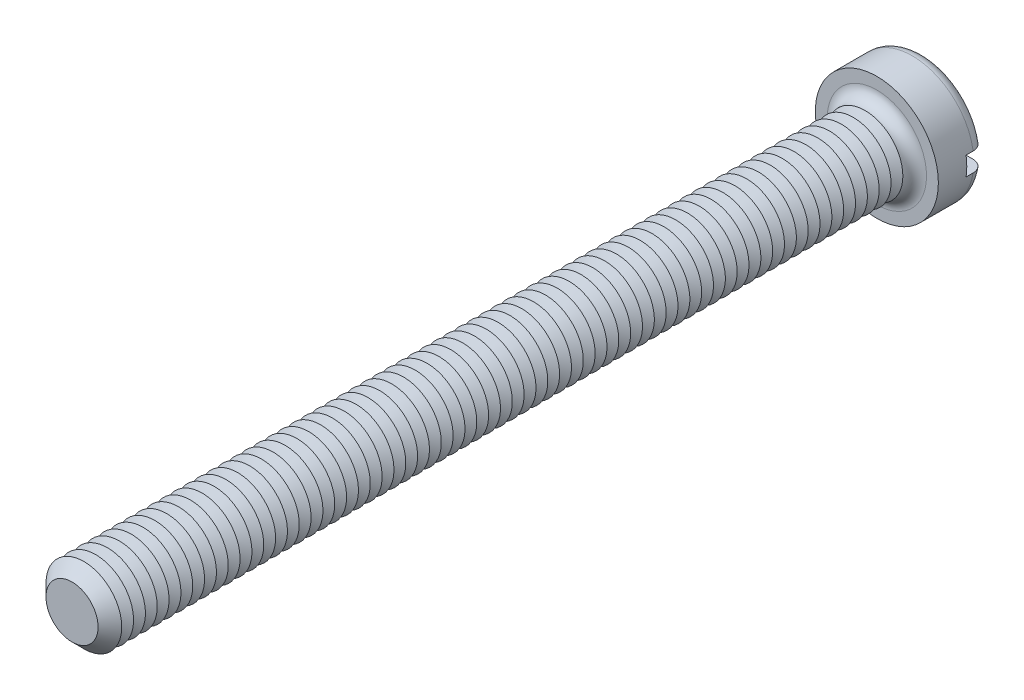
from build123d import *

# Parameters (mm, degrees)
SKETCH3_R           = 6.5
BOSS_EXTRUDE2_DEPTH = 5
SKETCH4_R           = 4
BOSS_EXTRUDE3_DEPTH = 85
FILLET1_R           = 1.25
CHAMFER1_SIZE       = 1.25
LPATTERN1_COUNT     = 66
LPATTERN1_PITCH     = 1.25
SKETCH8_W           = 13
SKETCH8_H           = 2
CUT_EXTRUDE1_DEPTH  = 2


with BuildPart() as part:
    # Sketch3 → Boss-Extrude2 (new body)
    with BuildSketch(Plane.XY):
        Circle(SKETCH3_R)
    extrude(amount=-BOSS_EXTRUDE2_DEPTH)

    # Sketch4 → Boss-Extrude3 (add)
    with BuildSketch(Plane.XY):
        Circle(SKETCH4_R)
    extrude(amount=BOSS_EXTRUDE3_DEPTH)

    # Fillet1
    fillet1_edges = [part.edges().sort_by_distance(p)[0] for p in [
        (-6.5, 0, -5),
        (-4, 0, 0),
    ]]
    fillet(fillet1_edges, radius=FILLET1_R)

    # Chamfer1
    chamfer1_edges = [part.edges().sort_by_distance(p)[0] for p in [
        (-4, 0, 85),
    ]]
    chamfer(chamfer1_edges, length=CHAMFER1_SIZE)

    # Sketch6 → Cut-Revolve1 (revolve, cut)
    with BuildSketch(Plane(origin=(0, 0, 0), x_dir=(0, 0, -1), z_dir=(1, 0, 0)), mode=Mode.PRIVATE) as cut_revolve1_sk:
        Polygon((-1.25, 4), (-1.875, 2.917468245), (-2.5, 4), align=None)
    cut_revolve1 = revolve(cut_revolve1_sk.sketch.rotate(Axis((0, 0, -1.694361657), (0, 0, 1)), 90), axis=Axis((0, 0, -1.694361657), (0, 0, 1)), mode=Mode.SUBTRACT)

    # LPattern1: Cut-Revolve1 ×66
    with Locations(*[(0, 0, i * LPATTERN1_PITCH) for i in range(1, LPATTERN1_COUNT)]):
        add(cut_revolve1, mode=Mode.SUBTRACT)

    # Sketch8 → Cut-Extrude1 (cut)
    with BuildSketch(Plane(origin=(0, 0, -5), x_dir=(-1, 0, 0), z_dir=(0, 0, -1))):
        Rectangle(SKETCH8_W, SKETCH8_H)
    extrude(amount=-CUT_EXTRUDE1_DEPTH, mode=Mode.SUBTRACT)


solid = part.part
